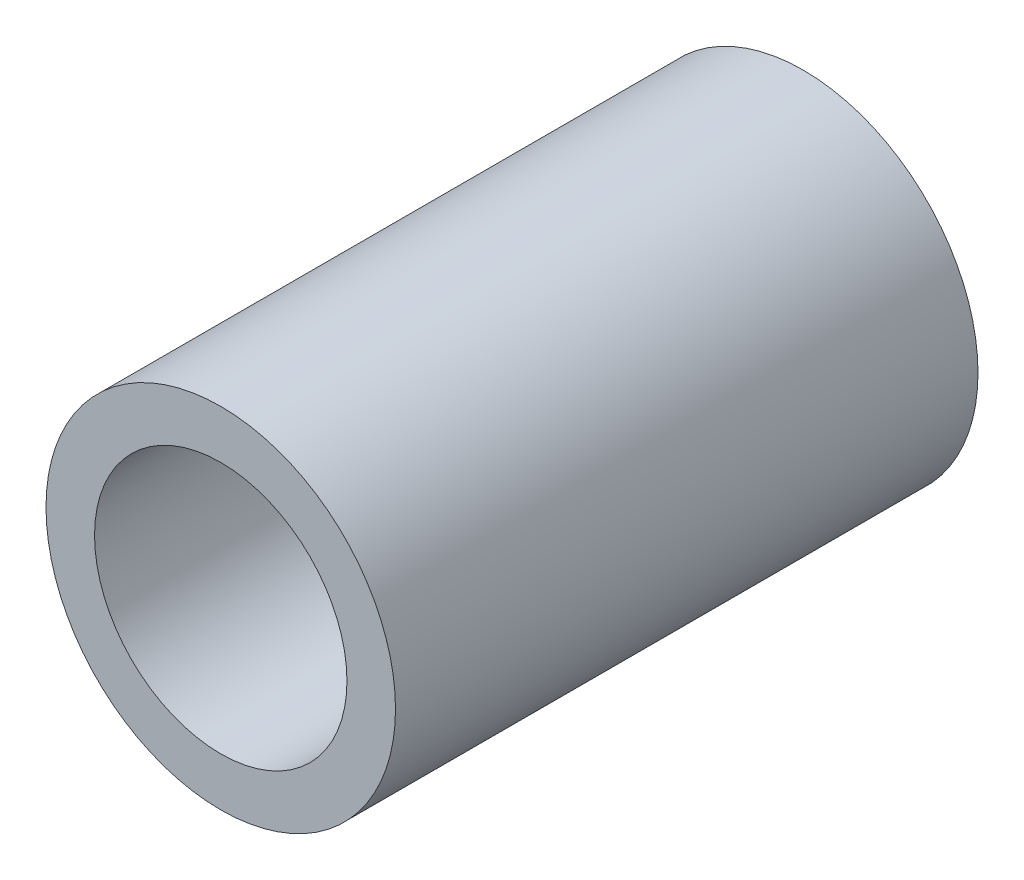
from build123d import *

# Parameters (mm, degrees)
SKETCH_1_R      = 9
SKETCH_1_R_2    = 6.5
EXTRUDE_1_DEPTH = 30


with BuildPart() as part:
    # Sketch 1 → Extrude 1 (new body)
    with BuildSketch(Plane.XY):
        Circle(SKETCH_1_R)
        Circle(SKETCH_1_R_2, mode=Mode.SUBTRACT)
    extrude(amount=EXTRUDE_1_DEPTH)


solid = part.part
